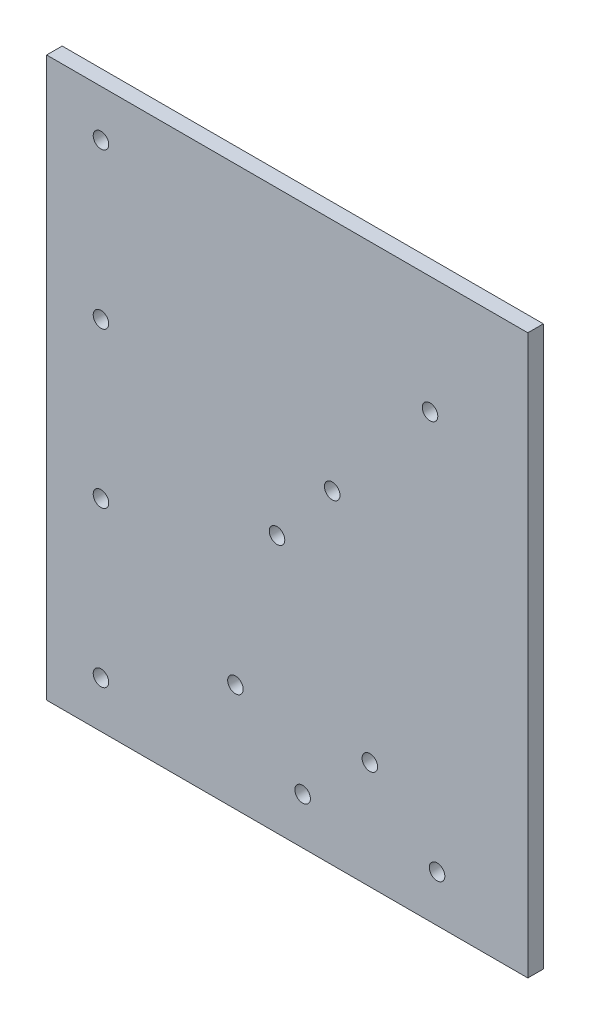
ISO-10303-21;
HEADER;
FILE_DESCRIPTION(('STEP AP214'),'2;1');
FILE_NAME('part.step','',(''),(''),'','','');
FILE_SCHEMA(('AUTOMOTIVE_DESIGN { 1 0 10303 214 1 1 1 1 }'));
ENDSEC;
DATA;
#1=APPLICATION_CONTEXT('core data for automotive mechanical design processes');
#2=APPLICATION_PROTOCOL_DEFINITION('international standard','automotive_design',2000,#1);
#3=PRODUCT_CONTEXT('',#1,'mechanical');
#4=PRODUCT('Part','Part','',(#3));
#5=PRODUCT_RELATED_PRODUCT_CATEGORY('part','',(#4));
#6=PRODUCT_DEFINITION_FORMATION('','',#4);
#7=PRODUCT_DEFINITION_CONTEXT('part definition',#1,'design');
#8=PRODUCT_DEFINITION('design','',#6,#7);
#9=PRODUCT_DEFINITION_SHAPE('','',#8);
#10=(LENGTH_UNIT() NAMED_UNIT(*) SI_UNIT(.MILLI.,.METRE.));
#11=(NAMED_UNIT(*) PLANE_ANGLE_UNIT() SI_UNIT($,.RADIAN.));
#12=(NAMED_UNIT(*) SI_UNIT($,.STERADIAN.) SOLID_ANGLE_UNIT());
#13=UNCERTAINTY_MEASURE_WITH_UNIT(LENGTH_MEASURE(1.E-05),#10,'distance_accuracy_value','');
#14=(GEOMETRIC_REPRESENTATION_CONTEXT(3) GLOBAL_UNCERTAINTY_ASSIGNED_CONTEXT((#13)) GLOBAL_UNIT_ASSIGNED_CONTEXT((#10,
#11,#12)) REPRESENTATION_CONTEXT('',''));
#15=CARTESIAN_POINT('',(0.,0.,0.));
#16=DIRECTION('',(0.,0.,1.));
#17=DIRECTION('',(1.,0.,0.));
#18=AXIS2_PLACEMENT_3D('',#15,#16,#17);
#19=CARTESIAN_POINT('',(0.,0.,12.7));
#20=DIRECTION('',(1.,0.,0.));
#21=DIRECTION('',(0.,0.,-1.));
#22=AXIS2_PLACEMENT_3D('',#19,#20,#21);
#23=PLANE('',#22);
#24=DIRECTION('',(0.,-1.,0.));
#25=VECTOR('',#24,1.);
#26=CARTESIAN_POINT('',(0.,0.,0.));
#27=LINE('',#26,#25);
#28=CARTESIAN_POINT('',(0.,457.2,0.));
#29=VERTEX_POINT('',#28);
#30=CARTESIAN_POINT('',(0.,0.,0.));
#31=VERTEX_POINT('',#30);
#32=EDGE_CURVE('E105',#29,#31,#27,.T.);
#33=ORIENTED_EDGE('',*,*,#32,.T.);
#34=DIRECTION('',(0.,0.,-1.));
#35=VECTOR('',#34,1.);
#36=CARTESIAN_POINT('',(0.,0.,12.7));
#37=LINE('',#36,#35);
#38=CARTESIAN_POINT('',(0.,0.,12.7));
#39=VERTEX_POINT('',#38);
#40=EDGE_CURVE('E96',#39,#31,#37,.T.);
#41=ORIENTED_EDGE('',*,*,#40,.F.);
#42=DIRECTION('',(0.,-1.,0.));
#43=VECTOR('',#42,1.);
#44=CARTESIAN_POINT('',(0.,0.,12.7));
#45=LINE('',#44,#43);
#46=CARTESIAN_POINT('',(0.,457.2,12.7));
#47=VERTEX_POINT('',#46);
#48=EDGE_CURVE('E90',#47,#39,#45,.T.);
#49=ORIENTED_EDGE('',*,*,#48,.F.);
#50=DIRECTION('',(0.,0.,-1.));
#51=VECTOR('',#50,1.);
#52=CARTESIAN_POINT('',(0.,457.2,12.7));
#53=LINE('',#52,#51);
#54=EDGE_CURVE('E101',#47,#29,#53,.T.);
#55=ORIENTED_EDGE('',*,*,#54,.T.);
#56=EDGE_LOOP('',(#33,#41,#49,#55));
#57=FACE_BOUND('',#56,.T.);
#58=ADVANCED_FACE('F34',(#57),#23,.F.);
#59=CARTESIAN_POINT('',(0.,0.,12.7));
#60=DIRECTION('',(0.,1.,0.));
#61=DIRECTION('',(0.,0.,1.));
#62=AXIS2_PLACEMENT_3D('',#59,#60,#61);
#63=PLANE('',#62);
#64=DIRECTION('',(1.,0.,0.));
#65=VECTOR('',#64,1.);
#66=CARTESIAN_POINT('',(0.,0.,0.));
#67=LINE('',#66,#65);
#68=CARTESIAN_POINT('',(393.7,0.,0.));
#69=VERTEX_POINT('',#68);
#70=EDGE_CURVE('E95',#31,#69,#67,.T.);
#71=ORIENTED_EDGE('',*,*,#70,.T.);
#72=DIRECTION('',(0.,0.,-1.));
#73=VECTOR('',#72,1.);
#74=CARTESIAN_POINT('',(393.7,0.,12.7));
#75=LINE('',#74,#73);
#76=CARTESIAN_POINT('',(393.7,0.,12.7));
#77=VERTEX_POINT('',#76);
#78=EDGE_CURVE('E93',#77,#69,#75,.T.);
#79=ORIENTED_EDGE('',*,*,#78,.F.);
#80=DIRECTION('',(1.,0.,0.));
#81=VECTOR('',#80,1.);
#82=CARTESIAN_POINT('',(0.,0.,12.7));
#83=LINE('',#82,#81);
#84=EDGE_CURVE('E84',#39,#77,#83,.T.);
#85=ORIENTED_EDGE('',*,*,#84,.F.);
#86=ORIENTED_EDGE('',*,*,#40,.T.);
#87=EDGE_LOOP('',(#71,#79,#85,#86));
#88=FACE_BOUND('',#87,.T.);
#89=ADVANCED_FACE('F94',(#88),#63,.F.);
#90=CARTESIAN_POINT('',(393.7,0.,12.7));
#91=DIRECTION('',(-1.,0.,0.));
#92=DIRECTION('',(0.,0.,1.));
#93=AXIS2_PLACEMENT_3D('',#90,#91,#92);
#94=PLANE('',#93);
#95=DIRECTION('',(0.,1.,0.));
#96=VECTOR('',#95,1.);
#97=CARTESIAN_POINT('',(393.7,0.,0.));
#98=LINE('',#97,#96);
#99=CARTESIAN_POINT('',(393.7,457.2,0.));
#100=VERTEX_POINT('',#99);
#101=EDGE_CURVE('E70',#69,#100,#98,.T.);
#102=ORIENTED_EDGE('',*,*,#101,.T.);
#103=DIRECTION('',(0.,0.,-1.));
#104=VECTOR('',#103,1.);
#105=CARTESIAN_POINT('',(393.7,457.2,12.7));
#106=LINE('',#105,#104);
#107=CARTESIAN_POINT('',(393.7,457.2,12.7));
#108=VERTEX_POINT('',#107);
#109=EDGE_CURVE('E97',#108,#100,#106,.T.);
#110=ORIENTED_EDGE('',*,*,#109,.F.);
#111=DIRECTION('',(0.,1.,0.));
#112=VECTOR('',#111,1.);
#113=CARTESIAN_POINT('',(393.7,0.,12.7));
#114=LINE('',#113,#112);
#115=EDGE_CURVE('E88',#77,#108,#114,.T.);
#116=ORIENTED_EDGE('',*,*,#115,.F.);
#117=ORIENTED_EDGE('',*,*,#78,.T.);
#118=EDGE_LOOP('',(#102,#110,#116,#117));
#119=FACE_BOUND('',#118,.T.);
#120=ADVANCED_FACE('F99',(#119),#94,.F.);
#121=CARTESIAN_POINT('',(0.,457.2,12.7));
#122=DIRECTION('',(0.,-1.,0.));
#123=DIRECTION('',(0.,0.,-1.));
#124=AXIS2_PLACEMENT_3D('',#121,#122,#123);
#125=PLANE('',#124);
#126=DIRECTION('',(-1.,0.,0.));
#127=VECTOR('',#126,1.);
#128=CARTESIAN_POINT('',(0.,457.2,0.));
#129=LINE('',#128,#127);
#130=EDGE_CURVE('E76',#100,#29,#129,.T.);
#131=ORIENTED_EDGE('',*,*,#130,.T.);
#132=ORIENTED_EDGE('',*,*,#54,.F.);
#133=DIRECTION('',(-1.,0.,0.));
#134=VECTOR('',#133,1.);
#135=CARTESIAN_POINT('',(0.,457.2,12.7));
#136=LINE('',#135,#134);
#137=EDGE_CURVE('E53',#108,#47,#136,.T.);
#138=ORIENTED_EDGE('',*,*,#137,.F.);
#139=ORIENTED_EDGE('',*,*,#109,.T.);
#140=EDGE_LOOP('',(#131,#132,#138,#139));
#141=FACE_BOUND('',#140,.T.);
#142=ADVANCED_FACE('F181',(#141),#125,.F.);
#143=CARTESIAN_POINT('',(0.,457.2,12.7));
#144=DIRECTION('',(0.,0.,-1.));
#145=DIRECTION('',(-1.,0.,0.));
#146=AXIS2_PLACEMENT_3D('',#143,#144,#145);
#147=PLANE('',#146);
#148=CARTESIAN_POINT('',(319.45,38.1,12.7));
#149=DIRECTION('',(0.,0.,1.));
#150=DIRECTION('',(1.,0.,0.));
#151=AXIS2_PLACEMENT_3D('',#148,#149,#150);
#152=CIRCLE('',#151,6.35000000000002);
#153=CARTESIAN_POINT('',(325.8,38.1,12.7));
#154=VERTEX_POINT('',#153);
#155=EDGE_CURVE('E152',#154,#154,#152,.T.);
#156=ORIENTED_EDGE('',*,*,#155,.F.);
#157=EDGE_LOOP('',(#156));
#158=FACE_BOUND('',#157,.T.);
#159=CARTESIAN_POINT('',(209.45,38.1,12.7));
#160=DIRECTION('',(0.,0.,1.));
#161=DIRECTION('',(1.,0.,0.));
#162=AXIS2_PLACEMENT_3D('',#159,#160,#161);
#163=CIRCLE('',#162,6.34999999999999);
#164=CARTESIAN_POINT('',(215.8,38.1,12.7));
#165=VERTEX_POINT('',#164);
#166=EDGE_CURVE('E141',#165,#165,#163,.T.);
#167=ORIENTED_EDGE('',*,*,#166,.F.);
#168=EDGE_LOOP('',(#167));
#169=FACE_BOUND('',#168,.T.);
#170=CARTESIAN_POINT('',(264.45,88.1,12.7));
#171=DIRECTION('',(0.,0.,1.));
#172=DIRECTION('',(1.,0.,0.));
#173=AXIS2_PLACEMENT_3D('',#170,#171,#172);
#174=CIRCLE('',#173,6.35000000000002);
#175=CARTESIAN_POINT('',(270.8,88.1,12.7));
#176=VERTEX_POINT('',#175);
#177=EDGE_CURVE('E140',#176,#176,#174,.T.);
#178=ORIENTED_EDGE('',*,*,#177,.F.);
#179=EDGE_LOOP('',(#178));
#180=FACE_BOUND('',#179,.T.);
#181=CARTESIAN_POINT('',(154.45,88.1,12.7));
#182=DIRECTION('',(0.,0.,1.));
#183=DIRECTION('',(1.,0.,0.));
#184=AXIS2_PLACEMENT_3D('',#181,#182,#183);
#185=CIRCLE('',#184,6.34999999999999);
#186=CARTESIAN_POINT('',(160.8,88.1,12.7));
#187=VERTEX_POINT('',#186);
#188=EDGE_CURVE('E137',#187,#187,#185,.T.);
#189=ORIENTED_EDGE('',*,*,#188,.F.);
#190=EDGE_LOOP('',(#189));
#191=FACE_BOUND('',#190,.T.);
#192=CARTESIAN_POINT('',(188.491489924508,210.94978790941,12.7));
#193=DIRECTION('',(0.,0.,1.));
#194=DIRECTION('',(1.,0.,0.));
#195=AXIS2_PLACEMENT_3D('',#192,#193,#194);
#196=CIRCLE('',#195,6.34999999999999);
#197=CARTESIAN_POINT('',(194.841489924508,210.94978790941,12.7));
#198=VERTEX_POINT('',#197);
#199=EDGE_CURVE('E134',#198,#198,#196,.T.);
#200=ORIENTED_EDGE('',*,*,#199,.F.);
#201=EDGE_LOOP('',(#200));
#202=FACE_BOUND('',#201,.T.);
#203=CARTESIAN_POINT('',(233.65390008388,265.144680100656,12.7));
#204=DIRECTION('',(0.,0.,1.));
#205=DIRECTION('',(1.,0.,0.));
#206=AXIS2_PLACEMENT_3D('',#203,#204,#205);
#207=CIRCLE('',#206,6.34999999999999);
#208=CARTESIAN_POINT('',(240.00390008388,265.144680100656,12.7));
#209=VERTEX_POINT('',#208);
#210=EDGE_CURVE('E130',#209,#209,#207,.T.);
#211=ORIENTED_EDGE('',*,*,#210,.F.);
#212=EDGE_LOOP('',(#211));
#213=FACE_BOUND('',#212,.T.);
#214=CARTESIAN_POINT('',(313.67695004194,361.172340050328,12.7));
#215=DIRECTION('',(0.,0.,1.));
#216=DIRECTION('',(1.,0.,0.));
#217=AXIS2_PLACEMENT_3D('',#214,#215,#216);
#218=CIRCLE('',#217,6.35000000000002);
#219=CARTESIAN_POINT('',(320.02695004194,361.172340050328,12.7));
#220=VERTEX_POINT('',#219);
#221=EDGE_CURVE('E129',#220,#220,#218,.T.);
#222=ORIENTED_EDGE('',*,*,#221,.F.);
#223=EDGE_LOOP('',(#222));
#224=FACE_BOUND('',#223,.T.);
#225=CARTESIAN_POINT('',(44.45,165.1,12.7));
#226=DIRECTION('',(0.,0.,1.));
#227=DIRECTION('',(1.,0.,0.));
#228=AXIS2_PLACEMENT_3D('',#225,#226,#227);
#229=CIRCLE('',#228,6.34999999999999);
#230=CARTESIAN_POINT('',(50.8,165.1,12.7));
#231=VERTEX_POINT('',#230);
#232=EDGE_CURVE('E171',#231,#231,#229,.T.);
#233=ORIENTED_EDGE('',*,*,#232,.F.);
#234=EDGE_LOOP('',(#233));
#235=FACE_BOUND('',#234,.T.);
#236=CARTESIAN_POINT('',(44.45,38.1,12.7));
#237=DIRECTION('',(0.,0.,1.));
#238=DIRECTION('',(1.,0.,0.));
#239=AXIS2_PLACEMENT_3D('',#236,#237,#238);
#240=CIRCLE('',#239,6.34999999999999);
#241=CARTESIAN_POINT('',(50.8,38.1,12.7));
#242=VERTEX_POINT('',#241);
#243=EDGE_CURVE('E118',#242,#242,#240,.T.);
#244=ORIENTED_EDGE('',*,*,#243,.F.);
#245=EDGE_LOOP('',(#244));
#246=FACE_BOUND('',#245,.T.);
#247=ORIENTED_EDGE('',*,*,#48,.T.);
#248=ORIENTED_EDGE('',*,*,#84,.T.);
#249=ORIENTED_EDGE('',*,*,#115,.T.);
#250=ORIENTED_EDGE('',*,*,#137,.T.);
#251=EDGE_LOOP('',(#247,#248,#249,#250));
#252=FACE_BOUND('',#251,.T.);
#253=CARTESIAN_POINT('',(44.45,292.1,12.7));
#254=DIRECTION('',(0.,0.,1.));
#255=DIRECTION('',(1.,0.,0.));
#256=AXIS2_PLACEMENT_3D('',#253,#254,#255);
#257=CIRCLE('',#256,6.34999999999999);
#258=CARTESIAN_POINT('',(50.8,292.1,12.7));
#259=VERTEX_POINT('',#258);
#260=EDGE_CURVE('E121',#259,#259,#257,.T.);
#261=ORIENTED_EDGE('',*,*,#260,.F.);
#262=EDGE_LOOP('',(#261));
#263=FACE_BOUND('',#262,.T.);
#264=CARTESIAN_POINT('',(44.45,419.1,12.7));
#265=DIRECTION('',(0.,0.,1.));
#266=DIRECTION('',(1.,0.,0.));
#267=AXIS2_PLACEMENT_3D('',#264,#265,#266);
#268=CIRCLE('',#267,6.34999999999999);
#269=CARTESIAN_POINT('',(50.8,419.1,12.7));
#270=VERTEX_POINT('',#269);
#271=EDGE_CURVE('E11',#270,#270,#268,.T.);
#272=ORIENTED_EDGE('',*,*,#271,.F.);
#273=EDGE_LOOP('',(#272));
#274=FACE_BOUND('',#273,.T.);
#275=ADVANCED_FACE('F85',(#158,#169,#180,#191,#202,#213,#224,#235,#246,#252,#263,#274),#147,.F.);
#276=CARTESIAN_POINT('',(0.,457.2,0.));
#277=DIRECTION('',(0.,0.,-1.));
#278=DIRECTION('',(-1.,0.,0.));
#279=AXIS2_PLACEMENT_3D('',#276,#277,#278);
#280=PLANE('',#279);
#281=CARTESIAN_POINT('',(319.45,38.1,0.));
#282=DIRECTION('',(0.,0.,-1.));
#283=DIRECTION('',(-1.,0.,0.));
#284=AXIS2_PLACEMENT_3D('',#281,#282,#283);
#285=CIRCLE('',#284,6.34999999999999);
#286=CARTESIAN_POINT('',(313.1,38.1,0.));
#287=VERTEX_POINT('',#286);
#288=EDGE_CURVE('E38',#287,#287,#285,.T.);
#289=ORIENTED_EDGE('',*,*,#288,.F.);
#290=EDGE_LOOP('',(#289));
#291=FACE_BOUND('',#290,.T.);
#292=CARTESIAN_POINT('',(209.45,38.1,0.));
#293=DIRECTION('',(0.,0.,-1.));
#294=DIRECTION('',(-1.,0.,0.));
#295=AXIS2_PLACEMENT_3D('',#292,#293,#294);
#296=CIRCLE('',#295,6.34999999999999);
#297=CARTESIAN_POINT('',(203.1,38.1,0.));
#298=VERTEX_POINT('',#297);
#299=EDGE_CURVE('E138',#298,#298,#296,.T.);
#300=ORIENTED_EDGE('',*,*,#299,.F.);
#301=EDGE_LOOP('',(#300));
#302=FACE_BOUND('',#301,.T.);
#303=CARTESIAN_POINT('',(264.45,88.1,0.));
#304=DIRECTION('',(0.,0.,-1.));
#305=DIRECTION('',(-1.,0.,0.));
#306=AXIS2_PLACEMENT_3D('',#303,#304,#305);
#307=CIRCLE('',#306,6.34999999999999);
#308=CARTESIAN_POINT('',(258.1,88.1,0.));
#309=VERTEX_POINT('',#308);
#310=EDGE_CURVE('E145',#309,#309,#307,.T.);
#311=ORIENTED_EDGE('',*,*,#310,.F.);
#312=EDGE_LOOP('',(#311));
#313=FACE_BOUND('',#312,.T.);
#314=CARTESIAN_POINT('',(154.45,88.1,0.));
#315=DIRECTION('',(0.,0.,-1.));
#316=DIRECTION('',(-1.,0.,0.));
#317=AXIS2_PLACEMENT_3D('',#314,#315,#316);
#318=CIRCLE('',#317,6.34999999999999);
#319=CARTESIAN_POINT('',(148.1,88.1,0.));
#320=VERTEX_POINT('',#319);
#321=EDGE_CURVE('E135',#320,#320,#318,.T.);
#322=ORIENTED_EDGE('',*,*,#321,.F.);
#323=EDGE_LOOP('',(#322));
#324=FACE_BOUND('',#323,.T.);
#325=CARTESIAN_POINT('',(188.491489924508,210.94978790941,0.));
#326=DIRECTION('',(0.,0.,-1.));
#327=DIRECTION('',(-1.,0.,0.));
#328=AXIS2_PLACEMENT_3D('',#325,#326,#327);
#329=CIRCLE('',#328,6.34999999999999);
#330=CARTESIAN_POINT('',(182.141489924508,210.94978790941,0.));
#331=VERTEX_POINT('',#330);
#332=EDGE_CURVE('E131',#331,#331,#329,.T.);
#333=ORIENTED_EDGE('',*,*,#332,.F.);
#334=EDGE_LOOP('',(#333));
#335=FACE_BOUND('',#334,.T.);
#336=CARTESIAN_POINT('',(233.65390008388,265.144680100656,0.));
#337=DIRECTION('',(0.,0.,-1.));
#338=DIRECTION('',(-1.,0.,0.));
#339=AXIS2_PLACEMENT_3D('',#336,#337,#338);
#340=CIRCLE('',#339,6.34999999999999);
#341=CARTESIAN_POINT('',(227.30390008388,265.144680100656,0.));
#342=VERTEX_POINT('',#341);
#343=EDGE_CURVE('E126',#342,#342,#340,.T.);
#344=ORIENTED_EDGE('',*,*,#343,.F.);
#345=EDGE_LOOP('',(#344));
#346=FACE_BOUND('',#345,.T.);
#347=CARTESIAN_POINT('',(313.67695004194,361.172340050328,0.));
#348=DIRECTION('',(0.,0.,-1.));
#349=DIRECTION('',(-1.,0.,0.));
#350=AXIS2_PLACEMENT_3D('',#347,#348,#349);
#351=CIRCLE('',#350,6.34999999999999);
#352=CARTESIAN_POINT('',(307.32695004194,361.172340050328,0.));
#353=VERTEX_POINT('',#352);
#354=EDGE_CURVE('E165',#353,#353,#351,.T.);
#355=ORIENTED_EDGE('',*,*,#354,.F.);
#356=EDGE_LOOP('',(#355));
#357=FACE_BOUND('',#356,.T.);
#358=CARTESIAN_POINT('',(44.45,165.1,0.));
#359=DIRECTION('',(0.,0.,-1.));
#360=DIRECTION('',(-1.,0.,0.));
#361=AXIS2_PLACEMENT_3D('',#358,#359,#360);
#362=CIRCLE('',#361,6.34999999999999);
#363=CARTESIAN_POINT('',(38.1,165.1,0.));
#364=VERTEX_POINT('',#363);
#365=EDGE_CURVE('E168',#364,#364,#362,.T.);
#366=ORIENTED_EDGE('',*,*,#365,.F.);
#367=EDGE_LOOP('',(#366));
#368=FACE_BOUND('',#367,.T.);
#369=CARTESIAN_POINT('',(44.45,38.1,0.));
#370=DIRECTION('',(0.,0.,-1.));
#371=DIRECTION('',(-1.,0.,0.));
#372=AXIS2_PLACEMENT_3D('',#369,#370,#371);
#373=CIRCLE('',#372,6.34999999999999);
#374=CARTESIAN_POINT('',(38.1,38.1,0.));
#375=VERTEX_POINT('',#374);
#376=EDGE_CURVE('E108',#375,#375,#373,.T.);
#377=ORIENTED_EDGE('',*,*,#376,.F.);
#378=EDGE_LOOP('',(#377));
#379=FACE_BOUND('',#378,.T.);
#380=ORIENTED_EDGE('',*,*,#32,.F.);
#381=ORIENTED_EDGE('',*,*,#130,.F.);
#382=ORIENTED_EDGE('',*,*,#101,.F.);
#383=ORIENTED_EDGE('',*,*,#70,.F.);
#384=EDGE_LOOP('',(#380,#381,#382,#383));
#385=FACE_BOUND('',#384,.T.);
#386=CARTESIAN_POINT('',(44.45,292.1,0.));
#387=DIRECTION('',(0.,0.,-1.));
#388=DIRECTION('',(-1.,0.,0.));
#389=AXIS2_PLACEMENT_3D('',#386,#387,#388);
#390=CIRCLE('',#389,6.34999999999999);
#391=CARTESIAN_POINT('',(38.1,292.1,0.));
#392=VERTEX_POINT('',#391);
#393=EDGE_CURVE('E115',#392,#392,#390,.T.);
#394=ORIENTED_EDGE('',*,*,#393,.F.);
#395=EDGE_LOOP('',(#394));
#396=FACE_BOUND('',#395,.T.);
#397=CARTESIAN_POINT('',(44.45,419.1,0.));
#398=DIRECTION('',(0.,0.,-1.));
#399=DIRECTION('',(-1.,0.,0.));
#400=AXIS2_PLACEMENT_3D('',#397,#398,#399);
#401=CIRCLE('',#400,6.34999999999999);
#402=CARTESIAN_POINT('',(38.1,419.1,0.));
#403=VERTEX_POINT('',#402);
#404=EDGE_CURVE('E44',#403,#403,#401,.T.);
#405=ORIENTED_EDGE('',*,*,#404,.F.);
#406=EDGE_LOOP('',(#405));
#407=FACE_BOUND('',#406,.T.);
#408=ADVANCED_FACE('F180',(#291,#302,#313,#324,#335,#346,#357,#368,#379,#385,#396,#407),#280,.T.);
#409=CARTESIAN_POINT('',(44.45,38.1,12.7));
#410=DIRECTION('',(0.,0.,1.));
#411=DIRECTION('',(1.,0.,0.));
#412=AXIS2_PLACEMENT_3D('',#409,#410,#411);
#413=CYLINDRICAL_SURFACE('',#412,6.34999999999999);
#414=ORIENTED_EDGE('',*,*,#376,.T.);
#415=EDGE_LOOP('',(#414));
#416=FACE_BOUND('',#415,.T.);
#417=ORIENTED_EDGE('',*,*,#243,.T.);
#418=EDGE_LOOP('',(#417));
#419=FACE_BOUND('',#418,.T.);
#420=ADVANCED_FACE('F177',(#416,#419),#413,.F.);
#421=CARTESIAN_POINT('',(44.45,165.1,12.7));
#422=DIRECTION('',(0.,0.,1.));
#423=DIRECTION('',(1.,0.,0.));
#424=AXIS2_PLACEMENT_3D('',#421,#422,#423);
#425=CYLINDRICAL_SURFACE('',#424,6.34999999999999);
#426=ORIENTED_EDGE('',*,*,#365,.T.);
#427=EDGE_LOOP('',(#426));
#428=FACE_BOUND('',#427,.T.);
#429=ORIENTED_EDGE('',*,*,#232,.T.);
#430=EDGE_LOOP('',(#429));
#431=FACE_BOUND('',#430,.T.);
#432=ADVANCED_FACE('F204',(#428,#431),#425,.F.);
#433=CARTESIAN_POINT('',(44.45,292.1,12.7));
#434=DIRECTION('',(0.,0.,1.));
#435=DIRECTION('',(1.,0.,0.));
#436=AXIS2_PLACEMENT_3D('',#433,#434,#435);
#437=CYLINDRICAL_SURFACE('',#436,6.34999999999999);
#438=ORIENTED_EDGE('',*,*,#393,.T.);
#439=EDGE_LOOP('',(#438));
#440=FACE_BOUND('',#439,.T.);
#441=ORIENTED_EDGE('',*,*,#260,.T.);
#442=EDGE_LOOP('',(#441));
#443=FACE_BOUND('',#442,.T.);
#444=ADVANCED_FACE('F202',(#440,#443),#437,.F.);
#445=CARTESIAN_POINT('',(44.45,419.1,12.7));
#446=DIRECTION('',(0.,0.,1.));
#447=DIRECTION('',(1.,0.,0.));
#448=AXIS2_PLACEMENT_3D('',#445,#446,#447);
#449=CYLINDRICAL_SURFACE('',#448,6.34999999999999);
#450=ORIENTED_EDGE('',*,*,#404,.T.);
#451=EDGE_LOOP('',(#450));
#452=FACE_BOUND('',#451,.T.);
#453=ORIENTED_EDGE('',*,*,#271,.T.);
#454=EDGE_LOOP('',(#453));
#455=FACE_BOUND('',#454,.T.);
#456=ADVANCED_FACE('F36',(#452,#455),#449,.F.);
#457=CARTESIAN_POINT('',(313.67695004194,361.172340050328,12.7));
#458=DIRECTION('',(0.,0.,1.));
#459=DIRECTION('',(1.,0.,0.));
#460=AXIS2_PLACEMENT_3D('',#457,#458,#459);
#461=CYLINDRICAL_SURFACE('',#460,6.34999999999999);
#462=ORIENTED_EDGE('',*,*,#354,.T.);
#463=EDGE_LOOP('',(#462));
#464=FACE_BOUND('',#463,.T.);
#465=ORIENTED_EDGE('',*,*,#221,.T.);
#466=EDGE_LOOP('',(#465));
#467=FACE_BOUND('',#466,.T.);
#468=ADVANCED_FACE('F210',(#464,#467),#461,.F.);
#469=CARTESIAN_POINT('',(233.65390008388,265.144680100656,12.7));
#470=DIRECTION('',(0.,0.,1.));
#471=DIRECTION('',(1.,0.,0.));
#472=AXIS2_PLACEMENT_3D('',#469,#470,#471);
#473=CYLINDRICAL_SURFACE('',#472,6.34999999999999);
#474=ORIENTED_EDGE('',*,*,#343,.T.);
#475=EDGE_LOOP('',(#474));
#476=FACE_BOUND('',#475,.T.);
#477=ORIENTED_EDGE('',*,*,#210,.T.);
#478=EDGE_LOOP('',(#477));
#479=FACE_BOUND('',#478,.T.);
#480=ADVANCED_FACE('F231',(#476,#479),#473,.F.);
#481=CARTESIAN_POINT('',(188.491489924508,210.94978790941,12.7));
#482=DIRECTION('',(0.,0.,1.));
#483=DIRECTION('',(1.,0.,0.));
#484=AXIS2_PLACEMENT_3D('',#481,#482,#483);
#485=CYLINDRICAL_SURFACE('',#484,6.34999999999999);
#486=ORIENTED_EDGE('',*,*,#332,.T.);
#487=EDGE_LOOP('',(#486));
#488=FACE_BOUND('',#487,.T.);
#489=ORIENTED_EDGE('',*,*,#199,.T.);
#490=EDGE_LOOP('',(#489));
#491=FACE_BOUND('',#490,.T.);
#492=ADVANCED_FACE('F235',(#488,#491),#485,.F.);
#493=CARTESIAN_POINT('',(154.45,88.1,12.7));
#494=DIRECTION('',(0.,0.,1.));
#495=DIRECTION('',(1.,0.,0.));
#496=AXIS2_PLACEMENT_3D('',#493,#494,#495);
#497=CYLINDRICAL_SURFACE('',#496,6.34999999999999);
#498=ORIENTED_EDGE('',*,*,#321,.T.);
#499=EDGE_LOOP('',(#498));
#500=FACE_BOUND('',#499,.T.);
#501=ORIENTED_EDGE('',*,*,#188,.T.);
#502=EDGE_LOOP('',(#501));
#503=FACE_BOUND('',#502,.T.);
#504=ADVANCED_FACE('F239',(#500,#503),#497,.F.);
#505=CARTESIAN_POINT('',(264.45,88.1,12.7));
#506=DIRECTION('',(0.,0.,1.));
#507=DIRECTION('',(1.,0.,0.));
#508=AXIS2_PLACEMENT_3D('',#505,#506,#507);
#509=CYLINDRICAL_SURFACE('',#508,6.34999999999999);
#510=ORIENTED_EDGE('',*,*,#310,.T.);
#511=EDGE_LOOP('',(#510));
#512=FACE_BOUND('',#511,.T.);
#513=ORIENTED_EDGE('',*,*,#177,.T.);
#514=EDGE_LOOP('',(#513));
#515=FACE_BOUND('',#514,.T.);
#516=ADVANCED_FACE('F243',(#512,#515),#509,.F.);
#517=CARTESIAN_POINT('',(209.45,38.1,12.7));
#518=DIRECTION('',(0.,0.,1.));
#519=DIRECTION('',(1.,0.,0.));
#520=AXIS2_PLACEMENT_3D('',#517,#518,#519);
#521=CYLINDRICAL_SURFACE('',#520,6.34999999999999);
#522=ORIENTED_EDGE('',*,*,#299,.T.);
#523=EDGE_LOOP('',(#522));
#524=FACE_BOUND('',#523,.T.);
#525=ORIENTED_EDGE('',*,*,#166,.T.);
#526=EDGE_LOOP('',(#525));
#527=FACE_BOUND('',#526,.T.);
#528=ADVANCED_FACE('F247',(#524,#527),#521,.F.);
#529=CARTESIAN_POINT('',(319.45,38.1,12.7));
#530=DIRECTION('',(0.,0.,1.));
#531=DIRECTION('',(1.,0.,0.));
#532=AXIS2_PLACEMENT_3D('',#529,#530,#531);
#533=CYLINDRICAL_SURFACE('',#532,6.34999999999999);
#534=ORIENTED_EDGE('',*,*,#288,.T.);
#535=EDGE_LOOP('',(#534));
#536=FACE_BOUND('',#535,.T.);
#537=ORIENTED_EDGE('',*,*,#155,.T.);
#538=EDGE_LOOP('',(#537));
#539=FACE_BOUND('',#538,.T.);
#540=ADVANCED_FACE('F251',(#536,#539),#533,.F.);
#541=CLOSED_SHELL('',(#58,#89,#120,#142,#275,#408,#420,#432,#444,#456,#468,#480,#492,#504,#516,
#528,#540));
#542=MANIFOLD_SOLID_BREP('B2',#541);
#543=ADVANCED_BREP_SHAPE_REPRESENTATION('',(#18,#542),#14);
#544=SHAPE_DEFINITION_REPRESENTATION(#9,#543);
ENDSEC;
END-ISO-10303-21;
